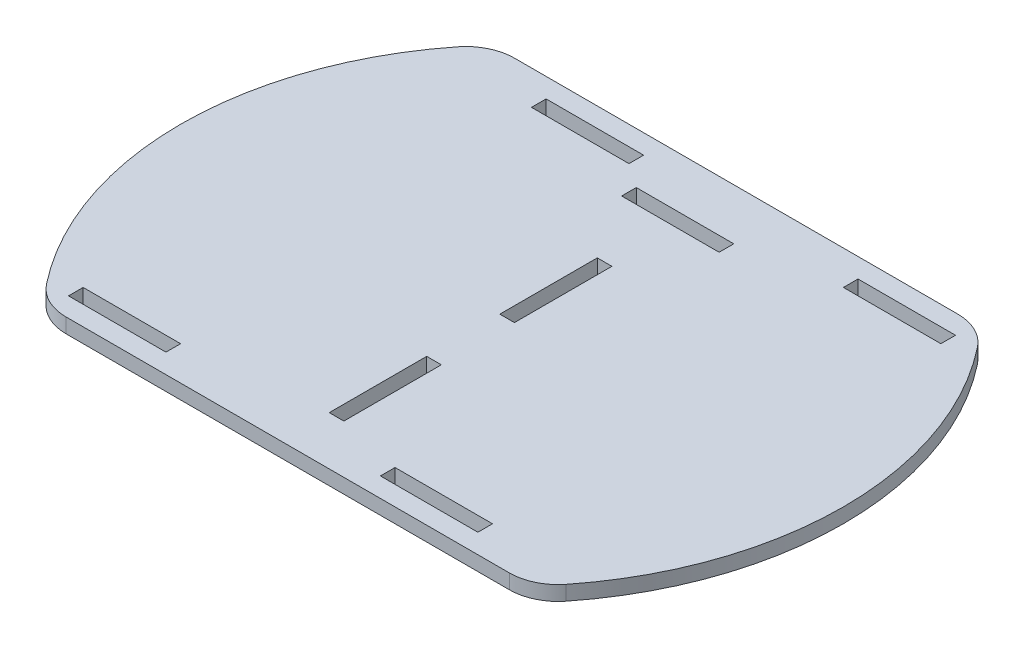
ISO-10303-21;
HEADER;
FILE_DESCRIPTION(('STEP AP214'),'2;1');
FILE_NAME('part.step','',(''),(''),'','','');
FILE_SCHEMA(('AUTOMOTIVE_DESIGN { 1 0 10303 214 1 1 1 1 }'));
ENDSEC;
DATA;
#1=APPLICATION_CONTEXT('core data for automotive mechanical design processes');
#2=APPLICATION_PROTOCOL_DEFINITION('international standard','automotive_design',2000,#1);
#3=PRODUCT_CONTEXT('',#1,'mechanical');
#4=PRODUCT('Part','Part','',(#3));
#5=PRODUCT_RELATED_PRODUCT_CATEGORY('part','',(#4));
#6=PRODUCT_DEFINITION_FORMATION('','',#4);
#7=PRODUCT_DEFINITION_CONTEXT('part definition',#1,'design');
#8=PRODUCT_DEFINITION('design','',#6,#7);
#9=PRODUCT_DEFINITION_SHAPE('','',#8);
#10=(LENGTH_UNIT() NAMED_UNIT(*) SI_UNIT(.MILLI.,.METRE.));
#11=(NAMED_UNIT(*) PLANE_ANGLE_UNIT() SI_UNIT($,.RADIAN.));
#12=(NAMED_UNIT(*) SI_UNIT($,.STERADIAN.) SOLID_ANGLE_UNIT());
#13=UNCERTAINTY_MEASURE_WITH_UNIT(LENGTH_MEASURE(1.E-05),#10,'distance_accuracy_value','');
#14=(GEOMETRIC_REPRESENTATION_CONTEXT(3) GLOBAL_UNCERTAINTY_ASSIGNED_CONTEXT((#13)) GLOBAL_UNIT_ASSIGNED_CONTEXT((#10,
#11,#12)) REPRESENTATION_CONTEXT('',''));
#15=CARTESIAN_POINT('',(0.,0.,0.));
#16=DIRECTION('',(0.,0.,1.));
#17=DIRECTION('',(1.,0.,0.));
#18=AXIS2_PLACEMENT_3D('',#15,#16,#17);
#19=CARTESIAN_POINT('',(0.,3.,0.));
#20=DIRECTION('',(0.,-1.,0.));
#21=DIRECTION('',(0.,0.,-1.));
#22=AXIS2_PLACEMENT_3D('',#19,#20,#21);
#23=PLANE('',#22);
#24=DIRECTION('',(1.,0.,0.));
#25=VECTOR('',#24,1.);
#26=CARTESIAN_POINT('',(-10.,3.,-32.5));
#27=LINE('',#26,#25);
#28=CARTESIAN_POINT('',(-10.,3.,-32.5));
#29=VERTEX_POINT('',#28);
#30=CARTESIAN_POINT('',(10.,3.,-32.5));
#31=VERTEX_POINT('',#30);
#32=EDGE_CURVE('E313',#29,#31,#27,.T.);
#33=ORIENTED_EDGE('',*,*,#32,.F.);
#34=DIRECTION('',(0.,0.,1.));
#35=VECTOR('',#34,1.);
#36=CARTESIAN_POINT('',(-10.,3.,-35.5));
#37=LINE('',#36,#35);
#38=CARTESIAN_POINT('',(-10.,3.,-35.5));
#39=VERTEX_POINT('',#38);
#40=EDGE_CURVE('E280',#39,#29,#37,.T.);
#41=ORIENTED_EDGE('',*,*,#40,.F.);
#42=DIRECTION('',(-1.,0.,0.));
#43=VECTOR('',#42,1.);
#44=CARTESIAN_POINT('',(-10.,3.,-35.5));
#45=LINE('',#44,#43);
#46=CARTESIAN_POINT('',(10.,3.,-35.5));
#47=VERTEX_POINT('',#46);
#48=EDGE_CURVE('E300',#47,#39,#45,.T.);
#49=ORIENTED_EDGE('',*,*,#48,.F.);
#50=DIRECTION('',(0.,0.,-1.));
#51=VECTOR('',#50,1.);
#52=CARTESIAN_POINT('',(10.,3.,-35.5));
#53=LINE('',#52,#51);
#54=EDGE_CURVE('E304',#31,#47,#53,.T.);
#55=ORIENTED_EDGE('',*,*,#54,.F.);
#56=EDGE_LOOP('',(#33,#41,#49,#55));
#57=FACE_BOUND('',#56,.T.);
#58=DIRECTION('',(1.,0.,0.));
#59=VECTOR('',#58,1.);
#60=CARTESIAN_POINT('',(1.5,3.,1.));
#61=LINE('',#60,#59);
#62=CARTESIAN_POINT('',(-1.5,3.,1.00000000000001));
#63=VERTEX_POINT('',#62);
#64=CARTESIAN_POINT('',(1.5,3.,1.));
#65=VERTEX_POINT('',#64);
#66=EDGE_CURVE('E353',#63,#65,#61,.T.);
#67=ORIENTED_EDGE('',*,*,#66,.F.);
#68=DIRECTION('',(0.,0.,1.));
#69=VECTOR('',#68,1.);
#70=CARTESIAN_POINT('',(-1.5,3.,1.00000000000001));
#71=LINE('',#70,#69);
#72=CARTESIAN_POINT('',(-1.5,3.,-19.));
#73=VERTEX_POINT('',#72);
#74=EDGE_CURVE('E350',#73,#63,#71,.T.);
#75=ORIENTED_EDGE('',*,*,#74,.F.);
#76=DIRECTION('',(-1.,0.,0.));
#77=VECTOR('',#76,1.);
#78=CARTESIAN_POINT('',(1.5,3.,-19.));
#79=LINE('',#78,#77);
#80=CARTESIAN_POINT('',(1.5,3.,-19.));
#81=VERTEX_POINT('',#80);
#82=EDGE_CURVE('E362',#81,#73,#79,.T.);
#83=ORIENTED_EDGE('',*,*,#82,.F.);
#84=DIRECTION('',(0.,0.,-1.));
#85=VECTOR('',#84,1.);
#86=CARTESIAN_POINT('',(1.5,3.,1.));
#87=LINE('',#86,#85);
#88=EDGE_CURVE('E358',#65,#81,#87,.T.);
#89=ORIENTED_EDGE('',*,*,#88,.F.);
#90=EDGE_LOOP('',(#67,#75,#83,#89));
#91=FACE_BOUND('',#90,.T.);
#92=DIRECTION('',(-1.,0.,0.));
#93=VECTOR('',#92,1.);
#94=CARTESIAN_POINT('',(-1.49999999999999,3.,16.));
#95=LINE('',#94,#93);
#96=CARTESIAN_POINT('',(1.50000000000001,3.,16.));
#97=VERTEX_POINT('',#96);
#98=CARTESIAN_POINT('',(-1.49999999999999,3.,16.));
#99=VERTEX_POINT('',#98);
#100=EDGE_CURVE('E382',#97,#99,#95,.T.);
#101=ORIENTED_EDGE('',*,*,#100,.F.);
#102=DIRECTION('',(0.,0.,-1.));
#103=VECTOR('',#102,1.);
#104=CARTESIAN_POINT('',(1.50000000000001,3.,36.));
#105=LINE('',#104,#103);
#106=CARTESIAN_POINT('',(1.50000000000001,3.,36.));
#107=VERTEX_POINT('',#106);
#108=EDGE_CURVE('E347',#107,#97,#105,.T.);
#109=ORIENTED_EDGE('',*,*,#108,.F.);
#110=DIRECTION('',(1.,0.,0.));
#111=VECTOR('',#110,1.);
#112=CARTESIAN_POINT('',(-1.49999999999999,3.,36.));
#113=LINE('',#112,#111);
#114=CARTESIAN_POINT('',(-1.49999999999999,3.,36.));
#115=VERTEX_POINT('',#114);
#116=EDGE_CURVE('E390',#115,#107,#113,.T.);
#117=ORIENTED_EDGE('',*,*,#116,.F.);
#118=DIRECTION('',(0.,0.,1.));
#119=VECTOR('',#118,1.);
#120=CARTESIAN_POINT('',(-1.49999999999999,3.,36.));
#121=LINE('',#120,#119);
#122=EDGE_CURVE('E386',#99,#115,#121,.T.);
#123=ORIENTED_EDGE('',*,*,#122,.F.);
#124=EDGE_LOOP('',(#101,#109,#117,#123));
#125=FACE_BOUND('',#124,.T.);
#126=DIRECTION('',(1.,0.,0.));
#127=VECTOR('',#126,1.);
#128=CARTESIAN_POINT('',(-35.,3.,-39.));
#129=LINE('',#128,#127);
#130=CARTESIAN_POINT('',(-35.,3.,-39.));
#131=VERTEX_POINT('',#130);
#132=CARTESIAN_POINT('',(-15.,3.,-39.));
#133=VERTEX_POINT('',#132);
#134=EDGE_CURVE('E466',#131,#133,#129,.T.);
#135=ORIENTED_EDGE('',*,*,#134,.F.);
#136=DIRECTION('',(0.,0.,1.));
#137=VECTOR('',#136,1.);
#138=CARTESIAN_POINT('',(-35.,3.,-42.));
#139=LINE('',#138,#137);
#140=CARTESIAN_POINT('',(-35.,3.,-42.));
#141=VERTEX_POINT('',#140);
#142=EDGE_CURVE('E370',#141,#131,#139,.T.);
#143=ORIENTED_EDGE('',*,*,#142,.F.);
#144=DIRECTION('',(-1.,0.,0.));
#145=VECTOR('',#144,1.);
#146=CARTESIAN_POINT('',(-35.,3.,-42.));
#147=LINE('',#146,#145);
#148=CARTESIAN_POINT('',(-15.,3.,-42.));
#149=VERTEX_POINT('',#148);
#150=EDGE_CURVE('E474',#149,#141,#147,.T.);
#151=ORIENTED_EDGE('',*,*,#150,.F.);
#152=DIRECTION('',(0.,0.,-1.));
#153=VECTOR('',#152,1.);
#154=CARTESIAN_POINT('',(-15.,3.,-42.));
#155=LINE('',#154,#153);
#156=EDGE_CURVE('E470',#133,#149,#155,.T.);
#157=ORIENTED_EDGE('',*,*,#156,.F.);
#158=EDGE_LOOP('',(#135,#143,#151,#157));
#159=FACE_BOUND('',#158,.T.);
#160=DIRECTION('',(1.,0.,0.));
#161=VECTOR('',#160,1.);
#162=CARTESIAN_POINT('',(29.,3.,-39.));
#163=LINE('',#162,#161);
#164=CARTESIAN_POINT('',(29.,3.,-39.));
#165=VERTEX_POINT('',#164);
#166=CARTESIAN_POINT('',(49.,3.,-39.));
#167=VERTEX_POINT('',#166);
#168=EDGE_CURVE('E439',#165,#167,#163,.T.);
#169=ORIENTED_EDGE('',*,*,#168,.F.);
#170=DIRECTION('',(0.,0.,1.));
#171=VECTOR('',#170,1.);
#172=CARTESIAN_POINT('',(29.,3.,-42.));
#173=LINE('',#172,#171);
#174=CARTESIAN_POINT('',(29.,3.,-42.));
#175=VERTEX_POINT('',#174);
#176=EDGE_CURVE('E436',#175,#165,#173,.T.);
#177=ORIENTED_EDGE('',*,*,#176,.F.);
#178=DIRECTION('',(-1.,0.,0.));
#179=VECTOR('',#178,1.);
#180=CARTESIAN_POINT('',(29.,3.,-42.));
#181=LINE('',#180,#179);
#182=CARTESIAN_POINT('',(49.,3.,-42.));
#183=VERTEX_POINT('',#182);
#184=EDGE_CURVE('E448',#183,#175,#181,.T.);
#185=ORIENTED_EDGE('',*,*,#184,.F.);
#186=DIRECTION('',(0.,0.,-1.));
#187=VECTOR('',#186,1.);
#188=CARTESIAN_POINT('',(49.,3.,-42.));
#189=LINE('',#188,#187);
#190=EDGE_CURVE('E444',#167,#183,#189,.T.);
#191=ORIENTED_EDGE('',*,*,#190,.F.);
#192=EDGE_LOOP('',(#169,#177,#185,#191));
#193=FACE_BOUND('',#192,.T.);
#194=DIRECTION('',(1.,0.,0.));
#195=VECTOR('',#194,1.);
#196=CARTESIAN_POINT('',(15.,3.,42.));
#197=LINE('',#196,#195);
#198=CARTESIAN_POINT('',(15.,3.,42.));
#199=VERTEX_POINT('',#198);
#200=CARTESIAN_POINT('',(35.,3.,42.));
#201=VERTEX_POINT('',#200);
#202=EDGE_CURVE('E409',#199,#201,#197,.T.);
#203=ORIENTED_EDGE('',*,*,#202,.F.);
#204=DIRECTION('',(0.,0.,1.));
#205=VECTOR('',#204,1.);
#206=CARTESIAN_POINT('',(15.,3.,39.));
#207=LINE('',#206,#205);
#208=CARTESIAN_POINT('',(15.,3.,39.));
#209=VERTEX_POINT('',#208);
#210=EDGE_CURVE('E406',#209,#199,#207,.T.);
#211=ORIENTED_EDGE('',*,*,#210,.F.);
#212=DIRECTION('',(-1.,0.,0.));
#213=VECTOR('',#212,1.);
#214=CARTESIAN_POINT('',(15.,3.,39.));
#215=LINE('',#214,#213);
#216=CARTESIAN_POINT('',(35.,3.,39.));
#217=VERTEX_POINT('',#216);
#218=EDGE_CURVE('E418',#217,#209,#215,.T.);
#219=ORIENTED_EDGE('',*,*,#218,.F.);
#220=DIRECTION('',(0.,0.,-1.));
#221=VECTOR('',#220,1.);
#222=CARTESIAN_POINT('',(35.,3.,39.));
#223=LINE('',#222,#221);
#224=EDGE_CURVE('E414',#201,#217,#223,.T.);
#225=ORIENTED_EDGE('',*,*,#224,.F.);
#226=EDGE_LOOP('',(#203,#211,#219,#225));
#227=FACE_BOUND('',#226,.T.);
#228=DIRECTION('',(1.,0.,0.));
#229=VECTOR('',#228,1.);
#230=CARTESIAN_POINT('',(-49.,3.,42.));
#231=LINE('',#230,#229);
#232=CARTESIAN_POINT('',(-49.,3.,42.));
#233=VERTEX_POINT('',#232);
#234=CARTESIAN_POINT('',(-29.,3.,42.));
#235=VERTEX_POINT('',#234);
#236=EDGE_CURVE('E492',#233,#235,#231,.T.);
#237=ORIENTED_EDGE('',*,*,#236,.F.);
#238=DIRECTION('',(0.,0.,1.));
#239=VECTOR('',#238,1.);
#240=CARTESIAN_POINT('',(-49.,3.,39.));
#241=LINE('',#240,#239);
#242=CARTESIAN_POINT('',(-49.,3.,39.));
#243=VERTEX_POINT('',#242);
#244=EDGE_CURVE('E426',#243,#233,#241,.T.);
#245=ORIENTED_EDGE('',*,*,#244,.F.);
#246=DIRECTION('',(-1.,0.,0.));
#247=VECTOR('',#246,1.);
#248=CARTESIAN_POINT('',(-49.,3.,39.));
#249=LINE('',#248,#247);
#250=CARTESIAN_POINT('',(-29.,3.,39.));
#251=VERTEX_POINT('',#250);
#252=EDGE_CURVE('E500',#251,#243,#249,.T.);
#253=ORIENTED_EDGE('',*,*,#252,.F.);
#254=DIRECTION('',(0.,0.,-1.));
#255=VECTOR('',#254,1.);
#256=CARTESIAN_POINT('',(-29.,3.,39.));
#257=LINE('',#256,#255);
#258=EDGE_CURVE('E496',#235,#251,#257,.T.);
#259=ORIENTED_EDGE('',*,*,#258,.F.);
#260=EDGE_LOOP('',(#237,#245,#253,#259));
#261=FACE_BOUND('',#260,.T.);
#262=DIRECTION('',(-1.,0.,0.));
#263=VECTOR('',#262,1.);
#264=CARTESIAN_POINT('',(-62.1982906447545,3.,46.));
#265=LINE('',#264,#263);
#266=CARTESIAN_POINT('',(45.4752680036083,3.,46.));
#267=VERTEX_POINT('',#266);
#268=CARTESIAN_POINT('',(-45.4752680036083,3.,46.));
#269=VERTEX_POINT('',#268);
#270=EDGE_CURVE('E343',#267,#269,#265,.T.);
#271=ORIENTED_EDGE('',*,*,#270,.F.);
#272=CARTESIAN_POINT('',(45.4752680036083,3.,36.));
#273=DIRECTION('',(0.,-1.,0.));
#274=DIRECTION('',(0.,0.,-1.));
#275=AXIS2_PLACEMENT_3D('',#272,#273,#274);
#276=CIRCLE('',#275,10.);
#277=CARTESIAN_POINT('',(53.3158314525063,3.,42.2068965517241));
#278=VERTEX_POINT('',#277);
#279=EDGE_CURVE('E618',#267,#278,#276,.F.);
#280=ORIENTED_EDGE('',*,*,#279,.T.);
#281=CARTESIAN_POINT('',(0.,3.,0.));
#282=DIRECTION('',(0.,-1.,0.));
#283=DIRECTION('',(0.,0.,-1.));
#284=AXIS2_PLACEMENT_3D('',#281,#282,#283);
#285=CIRCLE('',#284,68.);
#286=CARTESIAN_POINT('',(53.3158314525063,3.,-42.2068965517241));
#287=VERTEX_POINT('',#286);
#288=EDGE_CURVE('E333',#287,#278,#285,.T.);
#289=ORIENTED_EDGE('',*,*,#288,.F.);
#290=CARTESIAN_POINT('',(45.4752680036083,3.,-36.));
#291=DIRECTION('',(0.,-1.,0.));
#292=DIRECTION('',(0.,0.,-1.));
#293=AXIS2_PLACEMENT_3D('',#290,#291,#292);
#294=CIRCLE('',#293,10.);
#295=CARTESIAN_POINT('',(45.4752680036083,3.,-46.));
#296=VERTEX_POINT('',#295);
#297=EDGE_CURVE('E615',#287,#296,#294,.F.);
#298=ORIENTED_EDGE('',*,*,#297,.T.);
#299=DIRECTION('',(1.,0.,0.));
#300=VECTOR('',#299,1.);
#301=CARTESIAN_POINT('',(-62.1982906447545,3.,-46.));
#302=LINE('',#301,#300);
#303=CARTESIAN_POINT('',(-45.4752680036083,3.,-46.));
#304=VERTEX_POINT('',#303);
#305=EDGE_CURVE('E332',#304,#296,#302,.T.);
#306=ORIENTED_EDGE('',*,*,#305,.F.);
#307=CARTESIAN_POINT('',(-45.4752680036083,3.,-36.));
#308=DIRECTION('',(0.,-1.,0.));
#309=DIRECTION('',(0.,0.,-1.));
#310=AXIS2_PLACEMENT_3D('',#307,#308,#309);
#311=CIRCLE('',#310,10.);
#312=CARTESIAN_POINT('',(-53.3158314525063,3.,-42.2068965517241));
#313=VERTEX_POINT('',#312);
#314=EDGE_CURVE('E612',#304,#313,#311,.F.);
#315=ORIENTED_EDGE('',*,*,#314,.T.);
#316=CARTESIAN_POINT('',(0.,3.,0.));
#317=DIRECTION('',(0.,-1.,0.));
#318=DIRECTION('',(0.,0.,1.));
#319=AXIS2_PLACEMENT_3D('',#316,#317,#318);
#320=CIRCLE('',#319,68.);
#321=CARTESIAN_POINT('',(-53.3158314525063,3.,42.2068965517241));
#322=VERTEX_POINT('',#321);
#323=EDGE_CURVE('E322',#322,#313,#320,.T.);
#324=ORIENTED_EDGE('',*,*,#323,.F.);
#325=CARTESIAN_POINT('',(-45.4752680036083,3.,36.));
#326=DIRECTION('',(0.,-1.,0.));
#327=DIRECTION('',(0.,0.,-1.));
#328=AXIS2_PLACEMENT_3D('',#325,#326,#327);
#329=CIRCLE('',#328,10.);
#330=EDGE_CURVE('E609',#322,#269,#329,.F.);
#331=ORIENTED_EDGE('',*,*,#330,.T.);
#332=EDGE_LOOP('',(#271,#280,#289,#298,#306,#315,#324,#331));
#333=FACE_BOUND('',#332,.T.);
#334=ADVANCED_FACE('F38',(#57,#91,#125,#159,#193,#227,#261,#333),#23,.F.);
#335=CARTESIAN_POINT('',(0.,0.,0.));
#336=DIRECTION('',(0.,-1.,0.));
#337=DIRECTION('',(0.,0.,-1.));
#338=AXIS2_PLACEMENT_3D('',#335,#336,#337);
#339=PLANE('',#338);
#340=DIRECTION('',(0.,0.,1.));
#341=VECTOR('',#340,1.);
#342=CARTESIAN_POINT('',(-10.,0.,-35.5));
#343=LINE('',#342,#341);
#344=CARTESIAN_POINT('',(-10.,0.,-35.5));
#345=VERTEX_POINT('',#344);
#346=CARTESIAN_POINT('',(-10.,0.,-32.5));
#347=VERTEX_POINT('',#346);
#348=EDGE_CURVE('E277',#345,#347,#343,.T.);
#349=ORIENTED_EDGE('',*,*,#348,.T.);
#350=DIRECTION('',(1.,0.,0.));
#351=VECTOR('',#350,1.);
#352=CARTESIAN_POINT('',(-10.,0.,-32.5));
#353=LINE('',#352,#351);
#354=CARTESIAN_POINT('',(10.,0.,-32.5));
#355=VERTEX_POINT('',#354);
#356=EDGE_CURVE('E290',#347,#355,#353,.T.);
#357=ORIENTED_EDGE('',*,*,#356,.T.);
#358=DIRECTION('',(0.,0.,-1.));
#359=VECTOR('',#358,1.);
#360=CARTESIAN_POINT('',(10.,0.,-35.5));
#361=LINE('',#360,#359);
#362=CARTESIAN_POINT('',(10.,0.,-35.5));
#363=VERTEX_POINT('',#362);
#364=EDGE_CURVE('E295',#355,#363,#361,.T.);
#365=ORIENTED_EDGE('',*,*,#364,.T.);
#366=DIRECTION('',(-1.,0.,0.));
#367=VECTOR('',#366,1.);
#368=CARTESIAN_POINT('',(-10.,0.,-35.5));
#369=LINE('',#368,#367);
#370=EDGE_CURVE('E286',#363,#345,#369,.T.);
#371=ORIENTED_EDGE('',*,*,#370,.T.);
#372=EDGE_LOOP('',(#349,#357,#365,#371));
#373=FACE_BOUND('',#372,.T.);
#374=CARTESIAN_POINT('',(0.,0.,0.));
#375=DIRECTION('',(0.,-1.,0.));
#376=DIRECTION('',(0.,0.,-1.));
#377=AXIS2_PLACEMENT_3D('',#374,#375,#376);
#378=CIRCLE('',#377,68.);
#379=CARTESIAN_POINT('',(53.3158314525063,0.,-42.2068965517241));
#380=VERTEX_POINT('',#379);
#381=CARTESIAN_POINT('',(53.3158314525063,0.,42.2068965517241));
#382=VERTEX_POINT('',#381);
#383=EDGE_CURVE('E328',#380,#382,#378,.T.);
#384=ORIENTED_EDGE('',*,*,#383,.T.);
#385=CARTESIAN_POINT('',(45.4752680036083,0.,36.));
#386=DIRECTION('',(0.,-1.,0.));
#387=DIRECTION('',(0.,0.,-1.));
#388=AXIS2_PLACEMENT_3D('',#385,#386,#387);
#389=CIRCLE('',#388,10.);
#390=CARTESIAN_POINT('',(45.4752680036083,0.,46.));
#391=VERTEX_POINT('',#390);
#392=EDGE_CURVE('E636',#382,#391,#389,.T.);
#393=ORIENTED_EDGE('',*,*,#392,.T.);
#394=DIRECTION('',(1.,0.,0.));
#395=VECTOR('',#394,1.);
#396=CARTESIAN_POINT('',(0.,0.,46.));
#397=LINE('',#396,#395);
#398=CARTESIAN_POINT('',(-45.4752680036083,0.,46.));
#399=VERTEX_POINT('',#398);
#400=EDGE_CURVE('E598',#399,#391,#397,.T.);
#401=ORIENTED_EDGE('',*,*,#400,.F.);
#402=CARTESIAN_POINT('',(-45.4752680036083,0.,36.));
#403=DIRECTION('',(0.,-1.,0.));
#404=DIRECTION('',(0.,0.,-1.));
#405=AXIS2_PLACEMENT_3D('',#402,#403,#404);
#406=CIRCLE('',#405,10.);
#407=CARTESIAN_POINT('',(-53.3158314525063,0.,42.2068965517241));
#408=VERTEX_POINT('',#407);
#409=EDGE_CURVE('E628',#399,#408,#406,.T.);
#410=ORIENTED_EDGE('',*,*,#409,.T.);
#411=CARTESIAN_POINT('',(0.,0.,0.));
#412=DIRECTION('',(0.,-1.,0.));
#413=DIRECTION('',(0.,0.,1.));
#414=AXIS2_PLACEMENT_3D('',#411,#412,#413);
#415=CIRCLE('',#414,68.);
#416=CARTESIAN_POINT('',(-53.3158314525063,0.,-42.2068965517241));
#417=VERTEX_POINT('',#416);
#418=EDGE_CURVE('E337',#408,#417,#415,.T.);
#419=ORIENTED_EDGE('',*,*,#418,.T.);
#420=CARTESIAN_POINT('',(-45.4752680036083,0.,-36.));
#421=DIRECTION('',(0.,-1.,0.));
#422=DIRECTION('',(0.,0.,-1.));
#423=AXIS2_PLACEMENT_3D('',#420,#421,#422);
#424=CIRCLE('',#423,10.);
#425=CARTESIAN_POINT('',(-45.4752680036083,0.,-46.));
#426=VERTEX_POINT('',#425);
#427=EDGE_CURVE('E54',#417,#426,#424,.T.);
#428=ORIENTED_EDGE('',*,*,#427,.T.);
#429=DIRECTION('',(-1.,0.,0.));
#430=VECTOR('',#429,1.);
#431=CARTESIAN_POINT('',(0.,0.,-46.));
#432=LINE('',#431,#430);
#433=CARTESIAN_POINT('',(45.4752680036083,0.,-46.));
#434=VERTEX_POINT('',#433);
#435=EDGE_CURVE('E595',#434,#426,#432,.T.);
#436=ORIENTED_EDGE('',*,*,#435,.F.);
#437=CARTESIAN_POINT('',(45.4752680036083,0.,-36.));
#438=DIRECTION('',(0.,-1.,0.));
#439=DIRECTION('',(0.,0.,-1.));
#440=AXIS2_PLACEMENT_3D('',#437,#438,#439);
#441=CIRCLE('',#440,10.);
#442=EDGE_CURVE('E633',#434,#380,#441,.T.);
#443=ORIENTED_EDGE('',*,*,#442,.T.);
#444=EDGE_LOOP('',(#384,#393,#401,#410,#419,#428,#436,#443));
#445=FACE_BOUND('',#444,.T.);
#446=DIRECTION('',(0.,0.,-1.));
#447=VECTOR('',#446,1.);
#448=CARTESIAN_POINT('',(-1.5,0.,0.));
#449=LINE('',#448,#447);
#450=CARTESIAN_POINT('',(-1.5,0.,1.00000000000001));
#451=VERTEX_POINT('',#450);
#452=CARTESIAN_POINT('',(-1.5,0.,-19.));
#453=VERTEX_POINT('',#452);
#454=EDGE_CURVE('E592',#451,#453,#449,.T.);
#455=ORIENTED_EDGE('',*,*,#454,.F.);
#456=DIRECTION('',(-1.,0.,0.));
#457=VECTOR('',#456,1.);
#458=CARTESIAN_POINT('',(0.,0.,1.));
#459=LINE('',#458,#457);
#460=CARTESIAN_POINT('',(1.5,0.,1.));
#461=VERTEX_POINT('',#460);
#462=EDGE_CURVE('E582',#461,#451,#459,.T.);
#463=ORIENTED_EDGE('',*,*,#462,.F.);
#464=DIRECTION('',(0.,0.,1.));
#465=VECTOR('',#464,1.);
#466=CARTESIAN_POINT('',(1.5,0.,0.));
#467=LINE('',#466,#465);
#468=CARTESIAN_POINT('',(1.5,0.,-19.));
#469=VERTEX_POINT('',#468);
#470=EDGE_CURVE('E585',#469,#461,#467,.T.);
#471=ORIENTED_EDGE('',*,*,#470,.F.);
#472=DIRECTION('',(1.,0.,0.));
#473=VECTOR('',#472,1.);
#474=CARTESIAN_POINT('',(0.,0.,-19.));
#475=LINE('',#474,#473);
#476=EDGE_CURVE('E589',#453,#469,#475,.T.);
#477=ORIENTED_EDGE('',*,*,#476,.F.);
#478=EDGE_LOOP('',(#455,#463,#471,#477));
#479=FACE_BOUND('',#478,.T.);
#480=DIRECTION('',(0.,0.,1.));
#481=VECTOR('',#480,1.);
#482=CARTESIAN_POINT('',(1.50000000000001,0.,0.));
#483=LINE('',#482,#481);
#484=CARTESIAN_POINT('',(1.50000000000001,0.,16.));
#485=VERTEX_POINT('',#484);
#486=CARTESIAN_POINT('',(1.50000000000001,0.,36.));
#487=VERTEX_POINT('',#486);
#488=EDGE_CURVE('E579',#485,#487,#483,.T.);
#489=ORIENTED_EDGE('',*,*,#488,.F.);
#490=DIRECTION('',(1.,0.,0.));
#491=VECTOR('',#490,1.);
#492=CARTESIAN_POINT('',(0.,0.,16.));
#493=LINE('',#492,#491);
#494=CARTESIAN_POINT('',(-1.49999999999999,0.,16.));
#495=VERTEX_POINT('',#494);
#496=EDGE_CURVE('E569',#495,#485,#493,.T.);
#497=ORIENTED_EDGE('',*,*,#496,.F.);
#498=DIRECTION('',(0.,0.,-1.));
#499=VECTOR('',#498,1.);
#500=CARTESIAN_POINT('',(-1.49999999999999,0.,0.));
#501=LINE('',#500,#499);
#502=CARTESIAN_POINT('',(-1.49999999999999,0.,36.));
#503=VERTEX_POINT('',#502);
#504=EDGE_CURVE('E572',#503,#495,#501,.T.);
#505=ORIENTED_EDGE('',*,*,#504,.F.);
#506=DIRECTION('',(-1.,0.,0.));
#507=VECTOR('',#506,1.);
#508=CARTESIAN_POINT('',(0.,0.,36.));
#509=LINE('',#508,#507);
#510=EDGE_CURVE('E576',#487,#503,#509,.T.);
#511=ORIENTED_EDGE('',*,*,#510,.F.);
#512=EDGE_LOOP('',(#489,#497,#505,#511));
#513=FACE_BOUND('',#512,.T.);
#514=DIRECTION('',(0.,0.,-1.));
#515=VECTOR('',#514,1.);
#516=CARTESIAN_POINT('',(-35.,0.,0.));
#517=LINE('',#516,#515);
#518=CARTESIAN_POINT('',(-35.,0.,-39.));
#519=VERTEX_POINT('',#518);
#520=CARTESIAN_POINT('',(-35.,0.,-42.));
#521=VERTEX_POINT('',#520);
#522=EDGE_CURVE('E566',#519,#521,#517,.T.);
#523=ORIENTED_EDGE('',*,*,#522,.F.);
#524=DIRECTION('',(-1.,0.,0.));
#525=VECTOR('',#524,1.);
#526=CARTESIAN_POINT('',(0.,0.,-39.));
#527=LINE('',#526,#525);
#528=CARTESIAN_POINT('',(-15.,0.,-39.));
#529=VERTEX_POINT('',#528);
#530=EDGE_CURVE('E556',#529,#519,#527,.T.);
#531=ORIENTED_EDGE('',*,*,#530,.F.);
#532=DIRECTION('',(0.,0.,1.));
#533=VECTOR('',#532,1.);
#534=CARTESIAN_POINT('',(-15.,0.,0.));
#535=LINE('',#534,#533);
#536=CARTESIAN_POINT('',(-15.,0.,-42.));
#537=VERTEX_POINT('',#536);
#538=EDGE_CURVE('E559',#537,#529,#535,.T.);
#539=ORIENTED_EDGE('',*,*,#538,.F.);
#540=DIRECTION('',(1.,0.,0.));
#541=VECTOR('',#540,1.);
#542=CARTESIAN_POINT('',(0.,0.,-42.));
#543=LINE('',#542,#541);
#544=EDGE_CURVE('E563',#521,#537,#543,.T.);
#545=ORIENTED_EDGE('',*,*,#544,.F.);
#546=EDGE_LOOP('',(#523,#531,#539,#545));
#547=FACE_BOUND('',#546,.T.);
#548=DIRECTION('',(0.,0.,-1.));
#549=VECTOR('',#548,1.);
#550=CARTESIAN_POINT('',(29.,0.,0.));
#551=LINE('',#550,#549);
#552=CARTESIAN_POINT('',(29.,0.,-39.));
#553=VERTEX_POINT('',#552);
#554=CARTESIAN_POINT('',(29.,0.,-42.));
#555=VERTEX_POINT('',#554);
#556=EDGE_CURVE('E553',#553,#555,#551,.T.);
#557=ORIENTED_EDGE('',*,*,#556,.F.);
#558=DIRECTION('',(-1.,0.,0.));
#559=VECTOR('',#558,1.);
#560=CARTESIAN_POINT('',(0.,0.,-39.));
#561=LINE('',#560,#559);
#562=CARTESIAN_POINT('',(49.,0.,-39.));
#563=VERTEX_POINT('',#562);
#564=EDGE_CURVE('E543',#563,#553,#561,.T.);
#565=ORIENTED_EDGE('',*,*,#564,.F.);
#566=DIRECTION('',(0.,0.,1.));
#567=VECTOR('',#566,1.);
#568=CARTESIAN_POINT('',(49.,0.,0.));
#569=LINE('',#568,#567);
#570=CARTESIAN_POINT('',(49.,0.,-42.));
#571=VERTEX_POINT('',#570);
#572=EDGE_CURVE('E546',#571,#563,#569,.T.);
#573=ORIENTED_EDGE('',*,*,#572,.F.);
#574=DIRECTION('',(1.,0.,0.));
#575=VECTOR('',#574,1.);
#576=CARTESIAN_POINT('',(0.,0.,-42.));
#577=LINE('',#576,#575);
#578=EDGE_CURVE('E550',#555,#571,#577,.T.);
#579=ORIENTED_EDGE('',*,*,#578,.F.);
#580=EDGE_LOOP('',(#557,#565,#573,#579));
#581=FACE_BOUND('',#580,.T.);
#582=DIRECTION('',(0.,0.,-1.));
#583=VECTOR('',#582,1.);
#584=CARTESIAN_POINT('',(15.,0.,0.));
#585=LINE('',#584,#583);
#586=CARTESIAN_POINT('',(15.,0.,42.));
#587=VERTEX_POINT('',#586);
#588=CARTESIAN_POINT('',(15.,0.,39.));
#589=VERTEX_POINT('',#588);
#590=EDGE_CURVE('E540',#587,#589,#585,.T.);
#591=ORIENTED_EDGE('',*,*,#590,.F.);
#592=DIRECTION('',(-1.,0.,0.));
#593=VECTOR('',#592,1.);
#594=CARTESIAN_POINT('',(0.,0.,42.));
#595=LINE('',#594,#593);
#596=CARTESIAN_POINT('',(35.,0.,42.));
#597=VERTEX_POINT('',#596);
#598=EDGE_CURVE('E530',#597,#587,#595,.T.);
#599=ORIENTED_EDGE('',*,*,#598,.F.);
#600=DIRECTION('',(0.,0.,1.));
#601=VECTOR('',#600,1.);
#602=CARTESIAN_POINT('',(35.,0.,0.));
#603=LINE('',#602,#601);
#604=CARTESIAN_POINT('',(35.,0.,39.));
#605=VERTEX_POINT('',#604);
#606=EDGE_CURVE('E533',#605,#597,#603,.T.);
#607=ORIENTED_EDGE('',*,*,#606,.F.);
#608=DIRECTION('',(1.,0.,0.));
#609=VECTOR('',#608,1.);
#610=CARTESIAN_POINT('',(0.,0.,39.));
#611=LINE('',#610,#609);
#612=EDGE_CURVE('E537',#589,#605,#611,.T.);
#613=ORIENTED_EDGE('',*,*,#612,.F.);
#614=EDGE_LOOP('',(#591,#599,#607,#613));
#615=FACE_BOUND('',#614,.T.);
#616=DIRECTION('',(0.,0.,-1.));
#617=VECTOR('',#616,1.);
#618=CARTESIAN_POINT('',(-49.,0.,0.));
#619=LINE('',#618,#617);
#620=CARTESIAN_POINT('',(-49.,0.,42.));
#621=VERTEX_POINT('',#620);
#622=CARTESIAN_POINT('',(-49.,0.,39.));
#623=VERTEX_POINT('',#622);
#624=EDGE_CURVE('E527',#621,#623,#619,.T.);
#625=ORIENTED_EDGE('',*,*,#624,.F.);
#626=DIRECTION('',(-1.,0.,0.));
#627=VECTOR('',#626,1.);
#628=CARTESIAN_POINT('',(0.,0.,42.));
#629=LINE('',#628,#627);
#630=CARTESIAN_POINT('',(-29.,0.,42.));
#631=VERTEX_POINT('',#630);
#632=EDGE_CURVE('E508',#631,#621,#629,.T.);
#633=ORIENTED_EDGE('',*,*,#632,.F.);
#634=DIRECTION('',(0.,0.,1.));
#635=VECTOR('',#634,1.);
#636=CARTESIAN_POINT('',(-29.,0.,0.));
#637=LINE('',#636,#635);
#638=CARTESIAN_POINT('',(-29.,0.,39.));
#639=VERTEX_POINT('',#638);
#640=EDGE_CURVE('E520',#639,#631,#637,.T.);
#641=ORIENTED_EDGE('',*,*,#640,.F.);
#642=DIRECTION('',(1.,0.,0.));
#643=VECTOR('',#642,1.);
#644=CARTESIAN_POINT('',(0.,0.,39.));
#645=LINE('',#644,#643);
#646=EDGE_CURVE('E524',#623,#639,#645,.T.);
#647=ORIENTED_EDGE('',*,*,#646,.F.);
#648=EDGE_LOOP('',(#625,#633,#641,#647));
#649=FACE_BOUND('',#648,.T.);
#650=ADVANCED_FACE('F297',(#373,#445,#479,#513,#547,#581,#615,#649),#339,.T.);
#651=CARTESIAN_POINT('',(-49.,-7.,39.));
#652=DIRECTION('',(-1.,0.,0.));
#653=DIRECTION('',(0.,0.,1.));
#654=AXIS2_PLACEMENT_3D('',#651,#652,#653);
#655=PLANE('',#654);
#656=ORIENTED_EDGE('',*,*,#624,.T.);
#657=DIRECTION('',(0.,1.,0.));
#658=VECTOR('',#657,1.);
#659=CARTESIAN_POINT('',(-49.,-7.,39.));
#660=LINE('',#659,#658);
#661=EDGE_CURVE('E505',#623,#243,#660,.T.);
#662=ORIENTED_EDGE('',*,*,#661,.T.);
#663=ORIENTED_EDGE('',*,*,#244,.T.);
#664=DIRECTION('',(0.,1.,0.));
#665=VECTOR('',#664,1.);
#666=CARTESIAN_POINT('',(-49.,-7.,42.));
#667=LINE('',#666,#665);
#668=EDGE_CURVE('E504',#621,#233,#667,.T.);
#669=ORIENTED_EDGE('',*,*,#668,.F.);
#670=EDGE_LOOP('',(#656,#662,#663,#669));
#671=FACE_BOUND('',#670,.T.);
#672=ADVANCED_FACE('F690',(#671),#655,.F.);
#673=CARTESIAN_POINT('',(-49.,-7.,39.));
#674=DIRECTION('',(0.,0.,-1.));
#675=DIRECTION('',(-1.,0.,0.));
#676=AXIS2_PLACEMENT_3D('',#673,#674,#675);
#677=PLANE('',#676);
#678=ORIENTED_EDGE('',*,*,#646,.T.);
#679=DIRECTION('',(0.,1.,0.));
#680=VECTOR('',#679,1.);
#681=CARTESIAN_POINT('',(-29.,-7.,39.));
#682=LINE('',#681,#680);
#683=EDGE_CURVE('E509',#639,#251,#682,.T.);
#684=ORIENTED_EDGE('',*,*,#683,.T.);
#685=ORIENTED_EDGE('',*,*,#252,.T.);
#686=ORIENTED_EDGE('',*,*,#661,.F.);
#687=EDGE_LOOP('',(#678,#684,#685,#686));
#688=FACE_BOUND('',#687,.T.);
#689=ADVANCED_FACE('F975',(#688),#677,.F.);
#690=CARTESIAN_POINT('',(-29.,-7.,39.));
#691=DIRECTION('',(1.,0.,0.));
#692=DIRECTION('',(0.,0.,-1.));
#693=AXIS2_PLACEMENT_3D('',#690,#691,#692);
#694=PLANE('',#693);
#695=ORIENTED_EDGE('',*,*,#640,.T.);
#696=DIRECTION('',(0.,1.,0.));
#697=VECTOR('',#696,1.);
#698=CARTESIAN_POINT('',(-29.,-7.,42.));
#699=LINE('',#698,#697);
#700=EDGE_CURVE('E512',#631,#235,#699,.T.);
#701=ORIENTED_EDGE('',*,*,#700,.T.);
#702=ORIENTED_EDGE('',*,*,#258,.T.);
#703=ORIENTED_EDGE('',*,*,#683,.F.);
#704=EDGE_LOOP('',(#695,#701,#702,#703));
#705=FACE_BOUND('',#704,.T.);
#706=ADVANCED_FACE('F967',(#705),#694,.F.);
#707=CARTESIAN_POINT('',(-49.,-7.,42.));
#708=DIRECTION('',(0.,0.,1.));
#709=DIRECTION('',(1.,0.,0.));
#710=AXIS2_PLACEMENT_3D('',#707,#708,#709);
#711=PLANE('',#710);
#712=ORIENTED_EDGE('',*,*,#632,.T.);
#713=ORIENTED_EDGE('',*,*,#668,.T.);
#714=ORIENTED_EDGE('',*,*,#236,.T.);
#715=ORIENTED_EDGE('',*,*,#700,.F.);
#716=EDGE_LOOP('',(#712,#713,#714,#715));
#717=FACE_BOUND('',#716,.T.);
#718=ADVANCED_FACE('F958',(#717),#711,.F.);
#719=CARTESIAN_POINT('',(15.,-7.,39.));
#720=DIRECTION('',(-1.,0.,0.));
#721=DIRECTION('',(0.,0.,1.));
#722=AXIS2_PLACEMENT_3D('',#719,#720,#721);
#723=PLANE('',#722);
#724=ORIENTED_EDGE('',*,*,#590,.T.);
#725=DIRECTION('',(0.,1.,0.));
#726=VECTOR('',#725,1.);
#727=CARTESIAN_POINT('',(15.,-7.,39.));
#728=LINE('',#727,#726);
#729=EDGE_CURVE('E423',#589,#209,#728,.T.);
#730=ORIENTED_EDGE('',*,*,#729,.T.);
#731=ORIENTED_EDGE('',*,*,#210,.T.);
#732=DIRECTION('',(0.,1.,0.));
#733=VECTOR('',#732,1.);
#734=CARTESIAN_POINT('',(15.,-7.,42.));
#735=LINE('',#734,#733);
#736=EDGE_CURVE('E422',#587,#199,#735,.T.);
#737=ORIENTED_EDGE('',*,*,#736,.F.);
#738=EDGE_LOOP('',(#724,#730,#731,#737));
#739=FACE_BOUND('',#738,.T.);
#740=ADVANCED_FACE('F949',(#739),#723,.F.);
#741=CARTESIAN_POINT('',(15.,-7.,39.));
#742=DIRECTION('',(0.,0.,-1.));
#743=DIRECTION('',(-1.,0.,0.));
#744=AXIS2_PLACEMENT_3D('',#741,#742,#743);
#745=PLANE('',#744);
#746=ORIENTED_EDGE('',*,*,#612,.T.);
#747=DIRECTION('',(0.,1.,0.));
#748=VECTOR('',#747,1.);
#749=CARTESIAN_POINT('',(35.,-7.,39.));
#750=LINE('',#749,#748);
#751=EDGE_CURVE('E427',#605,#217,#750,.T.);
#752=ORIENTED_EDGE('',*,*,#751,.T.);
#753=ORIENTED_EDGE('',*,*,#218,.T.);
#754=ORIENTED_EDGE('',*,*,#729,.F.);
#755=EDGE_LOOP('',(#746,#752,#753,#754));
#756=FACE_BOUND('',#755,.T.);
#757=ADVANCED_FACE('F940',(#756),#745,.F.);
#758=CARTESIAN_POINT('',(35.,-7.,39.));
#759=DIRECTION('',(1.,0.,0.));
#760=DIRECTION('',(0.,0.,-1.));
#761=AXIS2_PLACEMENT_3D('',#758,#759,#760);
#762=PLANE('',#761);
#763=ORIENTED_EDGE('',*,*,#606,.T.);
#764=DIRECTION('',(0.,1.,0.));
#765=VECTOR('',#764,1.);
#766=CARTESIAN_POINT('',(35.,-7.,42.));
#767=LINE('',#766,#765);
#768=EDGE_CURVE('E430',#597,#201,#767,.T.);
#769=ORIENTED_EDGE('',*,*,#768,.T.);
#770=ORIENTED_EDGE('',*,*,#224,.T.);
#771=ORIENTED_EDGE('',*,*,#751,.F.);
#772=EDGE_LOOP('',(#763,#769,#770,#771));
#773=FACE_BOUND('',#772,.T.);
#774=ADVANCED_FACE('F931',(#773),#762,.F.);
#775=CARTESIAN_POINT('',(15.,-7.,42.));
#776=DIRECTION('',(0.,0.,1.));
#777=DIRECTION('',(1.,0.,0.));
#778=AXIS2_PLACEMENT_3D('',#775,#776,#777);
#779=PLANE('',#778);
#780=ORIENTED_EDGE('',*,*,#598,.T.);
#781=ORIENTED_EDGE('',*,*,#736,.T.);
#782=ORIENTED_EDGE('',*,*,#202,.T.);
#783=ORIENTED_EDGE('',*,*,#768,.F.);
#784=EDGE_LOOP('',(#780,#781,#782,#783));
#785=FACE_BOUND('',#784,.T.);
#786=ADVANCED_FACE('F922',(#785),#779,.F.);
#787=CARTESIAN_POINT('',(29.,-7.,-42.));
#788=DIRECTION('',(-1.,0.,0.));
#789=DIRECTION('',(0.,0.,1.));
#790=AXIS2_PLACEMENT_3D('',#787,#788,#789);
#791=PLANE('',#790);
#792=ORIENTED_EDGE('',*,*,#556,.T.);
#793=DIRECTION('',(0.,1.,0.));
#794=VECTOR('',#793,1.);
#795=CARTESIAN_POINT('',(29.,-7.,-42.));
#796=LINE('',#795,#794);
#797=EDGE_CURVE('E410',#555,#175,#796,.T.);
#798=ORIENTED_EDGE('',*,*,#797,.T.);
#799=ORIENTED_EDGE('',*,*,#176,.T.);
#800=DIRECTION('',(0.,1.,0.));
#801=VECTOR('',#800,1.);
#802=CARTESIAN_POINT('',(29.,-7.,-39.));
#803=LINE('',#802,#801);
#804=EDGE_CURVE('E452',#553,#165,#803,.T.);
#805=ORIENTED_EDGE('',*,*,#804,.F.);
#806=EDGE_LOOP('',(#792,#798,#799,#805));
#807=FACE_BOUND('',#806,.T.);
#808=ADVANCED_FACE('F913',(#807),#791,.F.);
#809=CARTESIAN_POINT('',(29.,-7.,-42.));
#810=DIRECTION('',(0.,0.,-1.));
#811=DIRECTION('',(-1.,0.,0.));
#812=AXIS2_PLACEMENT_3D('',#809,#810,#811);
#813=PLANE('',#812);
#814=ORIENTED_EDGE('',*,*,#578,.T.);
#815=DIRECTION('',(0.,1.,0.));
#816=VECTOR('',#815,1.);
#817=CARTESIAN_POINT('',(49.,-7.,-42.));
#818=LINE('',#817,#816);
#819=EDGE_CURVE('E455',#571,#183,#818,.T.);
#820=ORIENTED_EDGE('',*,*,#819,.T.);
#821=ORIENTED_EDGE('',*,*,#184,.T.);
#822=ORIENTED_EDGE('',*,*,#797,.F.);
#823=EDGE_LOOP('',(#814,#820,#821,#822));
#824=FACE_BOUND('',#823,.T.);
#825=ADVANCED_FACE('F904',(#824),#813,.F.);
#826=CARTESIAN_POINT('',(49.,-7.,-42.));
#827=DIRECTION('',(1.,0.,0.));
#828=DIRECTION('',(0.,0.,-1.));
#829=AXIS2_PLACEMENT_3D('',#826,#827,#828);
#830=PLANE('',#829);
#831=ORIENTED_EDGE('',*,*,#572,.T.);
#832=DIRECTION('',(0.,1.,0.));
#833=VECTOR('',#832,1.);
#834=CARTESIAN_POINT('',(49.,-7.,-39.));
#835=LINE('',#834,#833);
#836=EDGE_CURVE('E458',#563,#167,#835,.T.);
#837=ORIENTED_EDGE('',*,*,#836,.T.);
#838=ORIENTED_EDGE('',*,*,#190,.T.);
#839=ORIENTED_EDGE('',*,*,#819,.F.);
#840=EDGE_LOOP('',(#831,#837,#838,#839));
#841=FACE_BOUND('',#840,.T.);
#842=ADVANCED_FACE('F895',(#841),#830,.F.);
#843=CARTESIAN_POINT('',(29.,-7.,-39.));
#844=DIRECTION('',(0.,0.,1.));
#845=DIRECTION('',(1.,0.,0.));
#846=AXIS2_PLACEMENT_3D('',#843,#844,#845);
#847=PLANE('',#846);
#848=ORIENTED_EDGE('',*,*,#564,.T.);
#849=ORIENTED_EDGE('',*,*,#804,.T.);
#850=ORIENTED_EDGE('',*,*,#168,.T.);
#851=ORIENTED_EDGE('',*,*,#836,.F.);
#852=EDGE_LOOP('',(#848,#849,#850,#851));
#853=FACE_BOUND('',#852,.T.);
#854=ADVANCED_FACE('F886',(#853),#847,.F.);
#855=CARTESIAN_POINT('',(-35.,-7.,-42.));
#856=DIRECTION('',(-1.,0.,0.));
#857=DIRECTION('',(0.,0.,1.));
#858=AXIS2_PLACEMENT_3D('',#855,#856,#857);
#859=PLANE('',#858);
#860=ORIENTED_EDGE('',*,*,#522,.T.);
#861=DIRECTION('',(0.,1.,0.));
#862=VECTOR('',#861,1.);
#863=CARTESIAN_POINT('',(-35.,-7.,-42.));
#864=LINE('',#863,#862);
#865=EDGE_CURVE('E440',#521,#141,#864,.T.);
#866=ORIENTED_EDGE('',*,*,#865,.T.);
#867=ORIENTED_EDGE('',*,*,#142,.T.);
#868=DIRECTION('',(0.,1.,0.));
#869=VECTOR('',#868,1.);
#870=CARTESIAN_POINT('',(-35.,-7.,-39.));
#871=LINE('',#870,#869);
#872=EDGE_CURVE('E478',#519,#131,#871,.T.);
#873=ORIENTED_EDGE('',*,*,#872,.F.);
#874=EDGE_LOOP('',(#860,#866,#867,#873));
#875=FACE_BOUND('',#874,.T.);
#876=ADVANCED_FACE('F877',(#875),#859,.F.);
#877=CARTESIAN_POINT('',(-35.,-7.,-42.));
#878=DIRECTION('',(0.,0.,-1.));
#879=DIRECTION('',(-1.,0.,0.));
#880=AXIS2_PLACEMENT_3D('',#877,#878,#879);
#881=PLANE('',#880);
#882=ORIENTED_EDGE('',*,*,#544,.T.);
#883=DIRECTION('',(0.,1.,0.));
#884=VECTOR('',#883,1.);
#885=CARTESIAN_POINT('',(-15.,-7.,-42.));
#886=LINE('',#885,#884);
#887=EDGE_CURVE('E481',#537,#149,#886,.T.);
#888=ORIENTED_EDGE('',*,*,#887,.T.);
#889=ORIENTED_EDGE('',*,*,#150,.T.);
#890=ORIENTED_EDGE('',*,*,#865,.F.);
#891=EDGE_LOOP('',(#882,#888,#889,#890));
#892=FACE_BOUND('',#891,.T.);
#893=ADVANCED_FACE('F868',(#892),#881,.F.);
#894=CARTESIAN_POINT('',(-15.,-7.,-42.));
#895=DIRECTION('',(1.,0.,0.));
#896=DIRECTION('',(0.,0.,-1.));
#897=AXIS2_PLACEMENT_3D('',#894,#895,#896);
#898=PLANE('',#897);
#899=ORIENTED_EDGE('',*,*,#538,.T.);
#900=DIRECTION('',(0.,1.,0.));
#901=VECTOR('',#900,1.);
#902=CARTESIAN_POINT('',(-15.,-7.,-39.));
#903=LINE('',#902,#901);
#904=EDGE_CURVE('E484',#529,#133,#903,.T.);
#905=ORIENTED_EDGE('',*,*,#904,.T.);
#906=ORIENTED_EDGE('',*,*,#156,.T.);
#907=ORIENTED_EDGE('',*,*,#887,.F.);
#908=EDGE_LOOP('',(#899,#905,#906,#907));
#909=FACE_BOUND('',#908,.T.);
#910=ADVANCED_FACE('F859',(#909),#898,.F.);
#911=CARTESIAN_POINT('',(-35.,-7.,-39.));
#912=DIRECTION('',(0.,0.,1.));
#913=DIRECTION('',(1.,0.,0.));
#914=AXIS2_PLACEMENT_3D('',#911,#912,#913);
#915=PLANE('',#914);
#916=ORIENTED_EDGE('',*,*,#530,.T.);
#917=ORIENTED_EDGE('',*,*,#872,.T.);
#918=ORIENTED_EDGE('',*,*,#134,.T.);
#919=ORIENTED_EDGE('',*,*,#904,.F.);
#920=EDGE_LOOP('',(#916,#917,#918,#919));
#921=FACE_BOUND('',#920,.T.);
#922=ADVANCED_FACE('F850',(#921),#915,.F.);
#923=CARTESIAN_POINT('',(1.50000000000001,-7.,36.));
#924=DIRECTION('',(1.,0.,0.));
#925=DIRECTION('',(0.,0.,-1.));
#926=AXIS2_PLACEMENT_3D('',#923,#924,#925);
#927=PLANE('',#926);
#928=ORIENTED_EDGE('',*,*,#488,.T.);
#929=DIRECTION('',(0.,1.,0.));
#930=VECTOR('',#929,1.);
#931=CARTESIAN_POINT('',(1.50000000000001,-7.,36.));
#932=LINE('',#931,#930);
#933=EDGE_CURVE('E354',#487,#107,#932,.T.);
#934=ORIENTED_EDGE('',*,*,#933,.T.);
#935=ORIENTED_EDGE('',*,*,#108,.T.);
#936=DIRECTION('',(0.,1.,0.));
#937=VECTOR('',#936,1.);
#938=CARTESIAN_POINT('',(1.50000000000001,-7.,16.));
#939=LINE('',#938,#937);
#940=EDGE_CURVE('E394',#485,#97,#939,.T.);
#941=ORIENTED_EDGE('',*,*,#940,.F.);
#942=EDGE_LOOP('',(#928,#934,#935,#941));
#943=FACE_BOUND('',#942,.T.);
#944=ADVANCED_FACE('F841',(#943),#927,.F.);
#945=CARTESIAN_POINT('',(-1.49999999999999,-7.,36.));
#946=DIRECTION('',(0.,0.,1.));
#947=DIRECTION('',(1.,0.,0.));
#948=AXIS2_PLACEMENT_3D('',#945,#946,#947);
#949=PLANE('',#948);
#950=ORIENTED_EDGE('',*,*,#510,.T.);
#951=DIRECTION('',(0.,1.,0.));
#952=VECTOR('',#951,1.);
#953=CARTESIAN_POINT('',(-1.49999999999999,-7.,36.));
#954=LINE('',#953,#952);
#955=EDGE_CURVE('E397',#503,#115,#954,.T.);
#956=ORIENTED_EDGE('',*,*,#955,.T.);
#957=ORIENTED_EDGE('',*,*,#116,.T.);
#958=ORIENTED_EDGE('',*,*,#933,.F.);
#959=EDGE_LOOP('',(#950,#956,#957,#958));
#960=FACE_BOUND('',#959,.T.);
#961=ADVANCED_FACE('F832',(#960),#949,.F.);
#962=CARTESIAN_POINT('',(-1.49999999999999,-7.,36.));
#963=DIRECTION('',(-1.,0.,0.));
#964=DIRECTION('',(0.,0.,1.));
#965=AXIS2_PLACEMENT_3D('',#962,#963,#964);
#966=PLANE('',#965);
#967=ORIENTED_EDGE('',*,*,#504,.T.);
#968=DIRECTION('',(0.,1.,0.));
#969=VECTOR('',#968,1.);
#970=CARTESIAN_POINT('',(-1.49999999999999,-7.,16.));
#971=LINE('',#970,#969);
#972=EDGE_CURVE('E400',#495,#99,#971,.T.);
#973=ORIENTED_EDGE('',*,*,#972,.T.);
#974=ORIENTED_EDGE('',*,*,#122,.T.);
#975=ORIENTED_EDGE('',*,*,#955,.F.);
#976=EDGE_LOOP('',(#967,#973,#974,#975));
#977=FACE_BOUND('',#976,.T.);
#978=ADVANCED_FACE('F823',(#977),#966,.F.);
#979=CARTESIAN_POINT('',(-1.49999999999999,-7.,16.));
#980=DIRECTION('',(0.,0.,-1.));
#981=DIRECTION('',(-1.,0.,0.));
#982=AXIS2_PLACEMENT_3D('',#979,#980,#981);
#983=PLANE('',#982);
#984=ORIENTED_EDGE('',*,*,#496,.T.);
#985=ORIENTED_EDGE('',*,*,#940,.T.);
#986=ORIENTED_EDGE('',*,*,#100,.T.);
#987=ORIENTED_EDGE('',*,*,#972,.F.);
#988=EDGE_LOOP('',(#984,#985,#986,#987));
#989=FACE_BOUND('',#988,.T.);
#990=ADVANCED_FACE('F814',(#989),#983,.F.);
#991=CARTESIAN_POINT('',(-1.5,-7.,1.00000000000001));
#992=DIRECTION('',(-1.,0.,0.));
#993=DIRECTION('',(0.,0.,1.));
#994=AXIS2_PLACEMENT_3D('',#991,#992,#993);
#995=PLANE('',#994);
#996=ORIENTED_EDGE('',*,*,#454,.T.);
#997=DIRECTION('',(0.,1.,0.));
#998=VECTOR('',#997,1.);
#999=CARTESIAN_POINT('',(-1.5,-7.,-19.));
#1000=LINE('',#999,#998);
#1001=EDGE_CURVE('E367',#453,#73,#1000,.T.);
#1002=ORIENTED_EDGE('',*,*,#1001,.T.);
#1003=ORIENTED_EDGE('',*,*,#74,.T.);
#1004=DIRECTION('',(0.,1.,0.));
#1005=VECTOR('',#1004,1.);
#1006=CARTESIAN_POINT('',(-1.5,-7.,1.00000000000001));
#1007=LINE('',#1006,#1005);
#1008=EDGE_CURVE('E366',#451,#63,#1007,.T.);
#1009=ORIENTED_EDGE('',*,*,#1008,.F.);
#1010=EDGE_LOOP('',(#996,#1002,#1003,#1009));
#1011=FACE_BOUND('',#1010,.T.);
#1012=ADVANCED_FACE('F805',(#1011),#995,.F.);
#1013=CARTESIAN_POINT('',(1.5,-7.,-19.));
#1014=DIRECTION('',(0.,0.,-1.));
#1015=DIRECTION('',(-1.,0.,0.));
#1016=AXIS2_PLACEMENT_3D('',#1013,#1014,#1015);
#1017=PLANE('',#1016);
#1018=ORIENTED_EDGE('',*,*,#476,.T.);
#1019=DIRECTION('',(0.,1.,0.));
#1020=VECTOR('',#1019,1.);
#1021=CARTESIAN_POINT('',(1.5,-7.,-19.));
#1022=LINE('',#1021,#1020);
#1023=EDGE_CURVE('E371',#469,#81,#1022,.T.);
#1024=ORIENTED_EDGE('',*,*,#1023,.T.);
#1025=ORIENTED_EDGE('',*,*,#82,.T.);
#1026=ORIENTED_EDGE('',*,*,#1001,.F.);
#1027=EDGE_LOOP('',(#1018,#1024,#1025,#1026));
#1028=FACE_BOUND('',#1027,.T.);
#1029=ADVANCED_FACE('F796',(#1028),#1017,.F.);
#1030=CARTESIAN_POINT('',(1.5,-7.,1.));
#1031=DIRECTION('',(1.,0.,0.));
#1032=DIRECTION('',(0.,0.,-1.));
#1033=AXIS2_PLACEMENT_3D('',#1030,#1031,#1032);
#1034=PLANE('',#1033);
#1035=ORIENTED_EDGE('',*,*,#470,.T.);
#1036=DIRECTION('',(0.,1.,0.));
#1037=VECTOR('',#1036,1.);
#1038=CARTESIAN_POINT('',(1.5,-7.,1.));
#1039=LINE('',#1038,#1037);
#1040=EDGE_CURVE('E374',#461,#65,#1039,.T.);
#1041=ORIENTED_EDGE('',*,*,#1040,.T.);
#1042=ORIENTED_EDGE('',*,*,#88,.T.);
#1043=ORIENTED_EDGE('',*,*,#1023,.F.);
#1044=EDGE_LOOP('',(#1035,#1041,#1042,#1043));
#1045=FACE_BOUND('',#1044,.T.);
#1046=ADVANCED_FACE('F787',(#1045),#1034,.F.);
#1047=CARTESIAN_POINT('',(1.5,-7.,1.));
#1048=DIRECTION('',(0.,0.,1.));
#1049=DIRECTION('',(1.,0.,0.));
#1050=AXIS2_PLACEMENT_3D('',#1047,#1048,#1049);
#1051=PLANE('',#1050);
#1052=ORIENTED_EDGE('',*,*,#462,.T.);
#1053=ORIENTED_EDGE('',*,*,#1008,.T.);
#1054=ORIENTED_EDGE('',*,*,#66,.T.);
#1055=ORIENTED_EDGE('',*,*,#1040,.F.);
#1056=EDGE_LOOP('',(#1052,#1053,#1054,#1055));
#1057=FACE_BOUND('',#1056,.T.);
#1058=ADVANCED_FACE('F780',(#1057),#1051,.F.);
#1059=CARTESIAN_POINT('',(-62.1982906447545,0.,-46.));
#1060=DIRECTION('',(0.,0.,1.));
#1061=DIRECTION('',(1.,0.,0.));
#1062=AXIS2_PLACEMENT_3D('',#1059,#1060,#1061);
#1063=PLANE('',#1062);
#1064=ORIENTED_EDGE('',*,*,#305,.T.);
#1065=DIRECTION('',(0.,1.,0.));
#1066=VECTOR('',#1065,1.);
#1067=CARTESIAN_POINT('',(45.4752680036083,0.,-46.));
#1068=LINE('',#1067,#1066);
#1069=EDGE_CURVE('E61',#296,#434,#1068,.F.);
#1070=ORIENTED_EDGE('',*,*,#1069,.T.);
#1071=ORIENTED_EDGE('',*,*,#435,.T.);
#1072=DIRECTION('',(0.,1.,0.));
#1073=VECTOR('',#1072,1.);
#1074=CARTESIAN_POINT('',(-45.4752680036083,0.,-46.));
#1075=LINE('',#1074,#1073);
#1076=EDGE_CURVE('E639',#426,#304,#1075,.T.);
#1077=ORIENTED_EDGE('',*,*,#1076,.T.);
#1078=EDGE_LOOP('',(#1064,#1070,#1071,#1077));
#1079=FACE_BOUND('',#1078,.T.);
#1080=ADVANCED_FACE('F660',(#1079),#1063,.F.);
#1081=CARTESIAN_POINT('',(-62.1982906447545,0.,46.));
#1082=DIRECTION('',(0.,0.,-1.));
#1083=DIRECTION('',(-1.,0.,0.));
#1084=AXIS2_PLACEMENT_3D('',#1081,#1082,#1083);
#1085=PLANE('',#1084);
#1086=ORIENTED_EDGE('',*,*,#400,.T.);
#1087=DIRECTION('',(0.,1.,0.));
#1088=VECTOR('',#1087,1.);
#1089=CARTESIAN_POINT('',(45.4752680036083,0.,46.));
#1090=LINE('',#1089,#1088);
#1091=EDGE_CURVE('E605',#391,#267,#1090,.T.);
#1092=ORIENTED_EDGE('',*,*,#1091,.T.);
#1093=ORIENTED_EDGE('',*,*,#270,.T.);
#1094=DIRECTION('',(0.,1.,0.));
#1095=VECTOR('',#1094,1.);
#1096=CARTESIAN_POINT('',(-45.4752680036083,0.,46.));
#1097=LINE('',#1096,#1095);
#1098=EDGE_CURVE('E602',#269,#399,#1097,.F.);
#1099=ORIENTED_EDGE('',*,*,#1098,.T.);
#1100=EDGE_LOOP('',(#1086,#1092,#1093,#1099));
#1101=FACE_BOUND('',#1100,.T.);
#1102=ADVANCED_FACE('F676',(#1101),#1085,.F.);
#1103=CARTESIAN_POINT('',(0.,0.,0.));
#1104=DIRECTION('',(0.,1.,0.));
#1105=DIRECTION('',(0.,0.,1.));
#1106=AXIS2_PLACEMENT_3D('',#1103,#1104,#1105);
#1107=CYLINDRICAL_SURFACE('',#1106,68.);
#1108=ORIENTED_EDGE('',*,*,#323,.T.);
#1109=DIRECTION('',(0.,1.,0.));
#1110=VECTOR('',#1109,1.);
#1111=CARTESIAN_POINT('',(-53.3158314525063,0.,-42.2068965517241));
#1112=LINE('',#1111,#1110);
#1113=EDGE_CURVE('E11',#313,#417,#1112,.F.);
#1114=ORIENTED_EDGE('',*,*,#1113,.T.);
#1115=ORIENTED_EDGE('',*,*,#418,.F.);
#1116=DIRECTION('',(0.,1.,0.));
#1117=VECTOR('',#1116,1.);
#1118=CARTESIAN_POINT('',(-53.3158314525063,0.,42.2068965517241));
#1119=LINE('',#1118,#1117);
#1120=EDGE_CURVE('E47',#408,#322,#1119,.T.);
#1121=ORIENTED_EDGE('',*,*,#1120,.T.);
#1122=EDGE_LOOP('',(#1108,#1114,#1115,#1121));
#1123=FACE_BOUND('',#1122,.T.);
#1124=ADVANCED_FACE('F650',(#1123),#1107,.T.);
#1125=CARTESIAN_POINT('',(0.,0.,0.));
#1126=DIRECTION('',(0.,1.,0.));
#1127=DIRECTION('',(0.,0.,1.));
#1128=AXIS2_PLACEMENT_3D('',#1125,#1126,#1127);
#1129=CYLINDRICAL_SURFACE('',#1128,68.);
#1130=ORIENTED_EDGE('',*,*,#288,.T.);
#1131=DIRECTION('',(0.,1.,0.));
#1132=VECTOR('',#1131,1.);
#1133=CARTESIAN_POINT('',(53.3158314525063,0.,42.2068965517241));
#1134=LINE('',#1133,#1132);
#1135=EDGE_CURVE('E625',#278,#382,#1134,.F.);
#1136=ORIENTED_EDGE('',*,*,#1135,.T.);
#1137=ORIENTED_EDGE('',*,*,#383,.F.);
#1138=DIRECTION('',(0.,1.,0.));
#1139=VECTOR('',#1138,1.);
#1140=CARTESIAN_POINT('',(53.3158314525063,0.,-42.2068965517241));
#1141=LINE('',#1140,#1139);
#1142=EDGE_CURVE('E621',#380,#287,#1141,.T.);
#1143=ORIENTED_EDGE('',*,*,#1142,.T.);
#1144=EDGE_LOOP('',(#1130,#1136,#1137,#1143));
#1145=FACE_BOUND('',#1144,.T.);
#1146=ADVANCED_FACE('F669',(#1145),#1129,.T.);
#1147=CARTESIAN_POINT('',(-10.,0.,-35.5));
#1148=DIRECTION('',(-1.,0.,0.));
#1149=DIRECTION('',(0.,0.,1.));
#1150=AXIS2_PLACEMENT_3D('',#1147,#1148,#1149);
#1151=PLANE('',#1150);
#1152=ORIENTED_EDGE('',*,*,#40,.T.);
#1153=DIRECTION('',(0.,1.,0.));
#1154=VECTOR('',#1153,1.);
#1155=CARTESIAN_POINT('',(-10.,0.,-32.5));
#1156=LINE('',#1155,#1154);
#1157=EDGE_CURVE('E273',#347,#29,#1156,.T.);
#1158=ORIENTED_EDGE('',*,*,#1157,.F.);
#1159=ORIENTED_EDGE('',*,*,#348,.F.);
#1160=DIRECTION('',(0.,1.,0.));
#1161=VECTOR('',#1160,1.);
#1162=CARTESIAN_POINT('',(-10.,0.,-35.5));
#1163=LINE('',#1162,#1161);
#1164=EDGE_CURVE('E319',#345,#39,#1163,.T.);
#1165=ORIENTED_EDGE('',*,*,#1164,.T.);
#1166=EDGE_LOOP('',(#1152,#1158,#1159,#1165));
#1167=FACE_BOUND('',#1166,.T.);
#1168=ADVANCED_FACE('F275',(#1167),#1151,.F.);
#1169=CARTESIAN_POINT('',(-10.,0.,-35.5));
#1170=DIRECTION('',(0.,0.,-1.));
#1171=DIRECTION('',(-1.,0.,0.));
#1172=AXIS2_PLACEMENT_3D('',#1169,#1170,#1171);
#1173=PLANE('',#1172);
#1174=ORIENTED_EDGE('',*,*,#48,.T.);
#1175=ORIENTED_EDGE('',*,*,#1164,.F.);
#1176=ORIENTED_EDGE('',*,*,#370,.F.);
#1177=DIRECTION('',(0.,1.,0.));
#1178=VECTOR('',#1177,1.);
#1179=CARTESIAN_POINT('',(10.,0.,-35.5));
#1180=LINE('',#1179,#1178);
#1181=EDGE_CURVE('E323',#363,#47,#1180,.T.);
#1182=ORIENTED_EDGE('',*,*,#1181,.T.);
#1183=EDGE_LOOP('',(#1174,#1175,#1176,#1182));
#1184=FACE_BOUND('',#1183,.T.);
#1185=ADVANCED_FACE('F735',(#1184),#1173,.F.);
#1186=CARTESIAN_POINT('',(10.,0.,-35.5));
#1187=DIRECTION('',(1.,0.,0.));
#1188=DIRECTION('',(0.,0.,-1.));
#1189=AXIS2_PLACEMENT_3D('',#1186,#1187,#1188);
#1190=PLANE('',#1189);
#1191=ORIENTED_EDGE('',*,*,#54,.T.);
#1192=ORIENTED_EDGE('',*,*,#1181,.F.);
#1193=ORIENTED_EDGE('',*,*,#364,.F.);
#1194=DIRECTION('',(0.,1.,0.));
#1195=VECTOR('',#1194,1.);
#1196=CARTESIAN_POINT('',(10.,0.,-32.5));
#1197=LINE('',#1196,#1195);
#1198=EDGE_CURVE('E285',#355,#31,#1197,.T.);
#1199=ORIENTED_EDGE('',*,*,#1198,.T.);
#1200=EDGE_LOOP('',(#1191,#1192,#1193,#1199));
#1201=FACE_BOUND('',#1200,.T.);
#1202=ADVANCED_FACE('F727',(#1201),#1190,.F.);
#1203=CARTESIAN_POINT('',(-10.,0.,-32.5));
#1204=DIRECTION('',(0.,0.,1.));
#1205=DIRECTION('',(1.,0.,0.));
#1206=AXIS2_PLACEMENT_3D('',#1203,#1204,#1205);
#1207=PLANE('',#1206);
#1208=ORIENTED_EDGE('',*,*,#32,.T.);
#1209=ORIENTED_EDGE('',*,*,#1198,.F.);
#1210=ORIENTED_EDGE('',*,*,#356,.F.);
#1211=ORIENTED_EDGE('',*,*,#1157,.T.);
#1212=EDGE_LOOP('',(#1208,#1209,#1210,#1211));
#1213=FACE_BOUND('',#1212,.T.);
#1214=ADVANCED_FACE('F291',(#1213),#1207,.F.);
#1215=CARTESIAN_POINT('',(45.4752680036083,0.,36.));
#1216=DIRECTION('',(0.,1.,0.));
#1217=DIRECTION('',(0.,0.,1.));
#1218=AXIS2_PLACEMENT_3D('',#1215,#1216,#1217);
#1219=CYLINDRICAL_SURFACE('',#1218,10.);
#1220=ORIENTED_EDGE('',*,*,#392,.F.);
#1221=ORIENTED_EDGE('',*,*,#1135,.F.);
#1222=ORIENTED_EDGE('',*,*,#279,.F.);
#1223=ORIENTED_EDGE('',*,*,#1091,.F.);
#1224=EDGE_LOOP('',(#1220,#1221,#1222,#1223));
#1225=FACE_BOUND('',#1224,.T.);
#1226=ADVANCED_FACE('F674',(#1225),#1219,.T.);
#1227=CARTESIAN_POINT('',(45.4752680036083,0.,-36.));
#1228=DIRECTION('',(0.,1.,0.));
#1229=DIRECTION('',(0.,0.,1.));
#1230=AXIS2_PLACEMENT_3D('',#1227,#1228,#1229);
#1231=CYLINDRICAL_SURFACE('',#1230,10.);
#1232=ORIENTED_EDGE('',*,*,#442,.F.);
#1233=ORIENTED_EDGE('',*,*,#1069,.F.);
#1234=ORIENTED_EDGE('',*,*,#297,.F.);
#1235=ORIENTED_EDGE('',*,*,#1142,.F.);
#1236=EDGE_LOOP('',(#1232,#1233,#1234,#1235));
#1237=FACE_BOUND('',#1236,.T.);
#1238=ADVANCED_FACE('F666',(#1237),#1231,.T.);
#1239=CARTESIAN_POINT('',(-45.4752680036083,0.,-36.));
#1240=DIRECTION('',(0.,1.,0.));
#1241=DIRECTION('',(0.,0.,1.));
#1242=AXIS2_PLACEMENT_3D('',#1239,#1240,#1241);
#1243=CYLINDRICAL_SURFACE('',#1242,10.);
#1244=ORIENTED_EDGE('',*,*,#427,.F.);
#1245=ORIENTED_EDGE('',*,*,#1113,.F.);
#1246=ORIENTED_EDGE('',*,*,#314,.F.);
#1247=ORIENTED_EDGE('',*,*,#1076,.F.);
#1248=EDGE_LOOP('',(#1244,#1245,#1246,#1247));
#1249=FACE_BOUND('',#1248,.T.);
#1250=ADVANCED_FACE('F659',(#1249),#1243,.T.);
#1251=CARTESIAN_POINT('',(-45.4752680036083,0.,36.));
#1252=DIRECTION('',(0.,1.,0.));
#1253=DIRECTION('',(0.,0.,1.));
#1254=AXIS2_PLACEMENT_3D('',#1251,#1252,#1253);
#1255=CYLINDRICAL_SURFACE('',#1254,10.);
#1256=ORIENTED_EDGE('',*,*,#409,.F.);
#1257=ORIENTED_EDGE('',*,*,#1098,.F.);
#1258=ORIENTED_EDGE('',*,*,#330,.F.);
#1259=ORIENTED_EDGE('',*,*,#1120,.F.);
#1260=EDGE_LOOP('',(#1256,#1257,#1258,#1259));
#1261=FACE_BOUND('',#1260,.T.);
#1262=ADVANCED_FACE('F40',(#1261),#1255,.T.);
#1263=CLOSED_SHELL('',(#334,#650,#672,#689,#706,#718,#740,#757,#774,#786,#808,#825,#842,#854,
#876,#893,#910,#922,#944,#961,#978,#990,#1012,#1029,#1046,#1058,#1080,#1102,#1124,#1146,#1168,
#1185,#1202,#1214,#1226,#1238,#1250,#1262));
#1264=MANIFOLD_SOLID_BREP('B2',#1263);
#1265=ADVANCED_BREP_SHAPE_REPRESENTATION('',(#18,#1264),#14);
#1266=SHAPE_DEFINITION_REPRESENTATION(#9,#1265);
ENDSEC;
END-ISO-10303-21;
